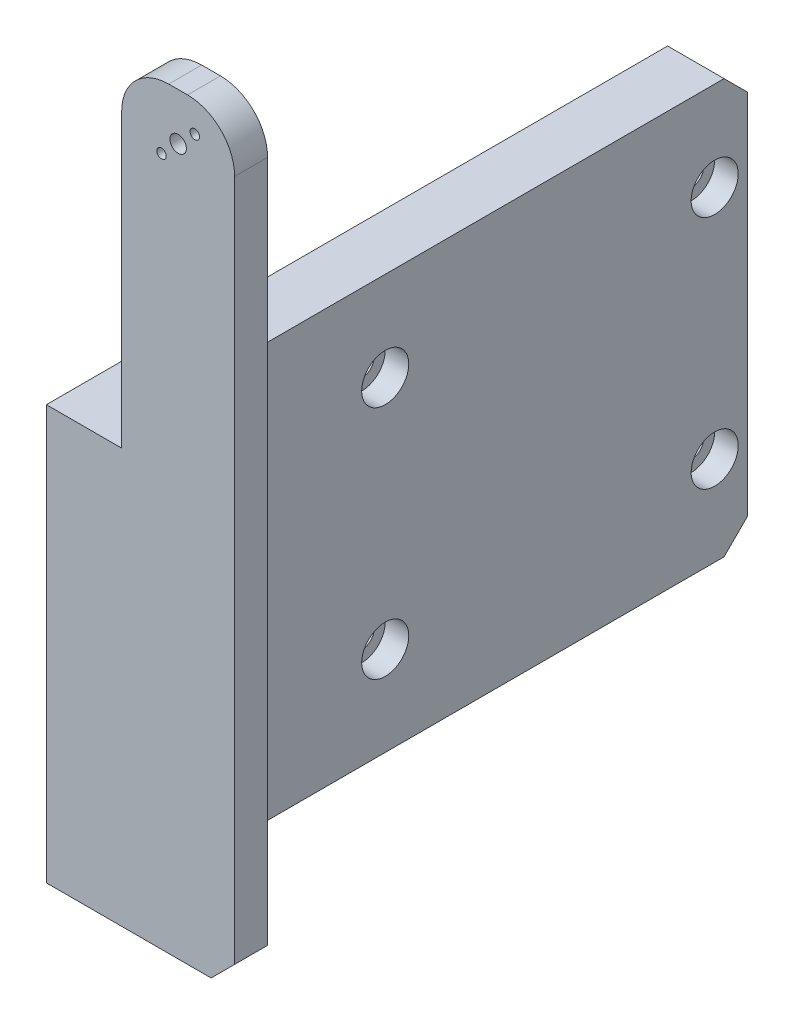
from build123d import *

# Parameters (mm, degrees)
ESQUISSE1_W             = 24
ESQUISSE1_H             = 160
BOSS_EXTRU_1_DEPTH      = 7
ESQUISSE2_W             = 7
ESQUISSE2_H             = 88
BOSS_EXTRU_2_DEPTH      = 16
ESQUISSE3_W             = 12
ESQUISSE3_H             = 88
BOSS_EXTRU_3_DEPTH      = 130
CONG_1_R                = 6
ESQUISSE4_R             = 1.75
ENL_V_MAT_EXTRU_1_DEPTH = 10
ESQUISSE6_R             = 1.00457
ENL_V_MAT_EXTRU_3_DEPTH = 10
CHANFREIN1_SIZE         = 0.5
CONG_2_R                = 10
CHANFREIN2_SIZE         = 5
ESQUISSE7_R             = 2.65
ENL_V_MAT_EXTRU_4_DEPTH = 790.246602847
ESQUISSE8_R             = 5
ENL_V_MAT_EXTRU_5_DEPTH = 5
ESQUISSE9_W             = 2
ESQUISSE9_H             = 2.033002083
ENL_V_MAT_EXTRU_6_DEPTH = 2260.834764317


with BuildPart() as part:
    # Esquisse1 → Boss.-Extru.1 (new body)
    with BuildSketch(Plane.XY):
        with Locations((2242.375559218, 697.962852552)):
            Rectangle(ESQUISSE1_W, ESQUISSE1_H)
    extrude(amount=BOSS_EXTRU_1_DEPTH)

    # Esquisse2 → Boss.-Extru.2 (add)
    with BuildSketch(Plane.ZY.offset(-2230.375559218)):
        with Locations((3.5, 661.962852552)):
            Rectangle(ESQUISSE2_W, ESQUISSE2_H)
    extrude(amount=BOSS_EXTRU_2_DEPTH)

    # Esquisse3 → Boss.-Extru.3 (add)
    with BuildSketch(Plane(origin=(0, 0, 0), x_dir=(-1, 0, 0), z_dir=(0, 0, -1))):
        with Locations((-2220.375559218, 661.962852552)):
            Rectangle(ESQUISSE3_W, ESQUISSE3_H)
    extrude(amount=BOSS_EXTRU_3_DEPTH)

    # Cong_1
    cong_1_edges = [part.edges().sort_by_distance(p)[0] for p in [
        (2226.375559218, 661.962852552, 0),
    ]]
    fillet(cong_1_edges, radius=CONG_1_R)

    # Esquisse4 → Enl_v. mat.-Extru.1 (cut)
    with BuildSketch(Plane.XY.offset(7)):
        with Locations((2242.375559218, 767.962852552)):
            Circle(ESQUISSE4_R)
    extrude(amount=-ENL_V_MAT_EXTRU_1_DEPTH, mode=Mode.SUBTRACT)

    # Esquisse6 → Enl_v. mat.-Extru.3 (cut)
    with BuildSketch(Plane.XY.offset(7)):
        with Locations((2245.913913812, 771.500939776)):
            Circle(ESQUISSE6_R)
        with Locations((2238.837204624, 764.424765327)):
            Circle(ESQUISSE6_R)
    extrude(amount=-ENL_V_MAT_EXTRU_3_DEPTH, mode=Mode.SUBTRACT)

    # Chanfrein1
    chanfrein1_edges = [part.edges().sort_by_distance(p)[0] for p in [
        (2244.909343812, 771.500939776, 0),
        (2237.832634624, 764.424765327, 0),
    ]]
    chamfer(chanfrein1_edges, length=CHANFREIN1_SIZE)

    # Cong_2
    cong_2_edges = [part.edges().sort_by_distance(p)[0] for p in [
        (2254.375559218, 777.962852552, 3.5),
        (2230.375559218, 777.962852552, 3.328427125),
    ]]
    fillet(cong_2_edges, radius=CONG_2_R)

    # Chanfrein2
    chanfrein2_edges = [part.edges().sort_by_distance(p)[0] for p in [
        (2220.375559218, 705.962852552, -130),
        (2220.375559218, 617.962852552, -130),
        (2254.375559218, 617.962852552, 3.5),
    ]]
    chamfer(chanfrein2_edges, length=CHANFREIN2_SIZE)

    # Esquisse7 → Enl_v. mat.-Extru.4 (cut, through all)
    with BuildSketch(Plane(origin=(2226.375559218, 0, 0), x_dir=(0, 0, -1), z_dir=(1, 0, 0))):
        with Locations((123, 636.962852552)):
            Circle(ESQUISSE7_R)
        with Locations((123, 686.962852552)):
            Circle(ESQUISSE7_R)
        with Locations((53, 636.962852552)):
            Circle(ESQUISSE7_R)
        with Locations((53, 686.962852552)):
            Circle(ESQUISSE7_R)
    extrude(amount=-ENL_V_MAT_EXTRU_4_DEPTH, mode=Mode.SUBTRACT)

    # Esquisse8 → Enl_v. mat.-Extru.5 (cut)
    with BuildSketch(Plane(origin=(2226.375559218, 0, 0), x_dir=(0, 0, -1), z_dir=(1, 0, 0))):
        with Locations((53, 686.962852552)):
            Circle(ESQUISSE8_R)
        with Locations((123, 686.962852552)):
            Circle(ESQUISSE8_R)
        with Locations((53, 636.962852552)):
            Circle(ESQUISSE8_R)
        with Locations((123, 636.962852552)):
            Circle(ESQUISSE8_R)
    extrude(amount=-ENL_V_MAT_EXTRU_5_DEPTH, mode=Mode.SUBTRACT)

    # Esquisse9 → Enl_v. mat.-Extru.6 (cut, through all)
    with BuildSketch(Plane(origin=(0, 705.962852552, 0), x_dir=(1, 0, 0), z_dir=(0, 1, 0))):
        with Locations((2231.375559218, 1.016501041)):
            Rectangle(ESQUISSE9_W, ESQUISSE9_H)
    extrude(amount=ENL_V_MAT_EXTRU_6_DEPTH, mode=Mode.SUBTRACT)


solid = part.part
